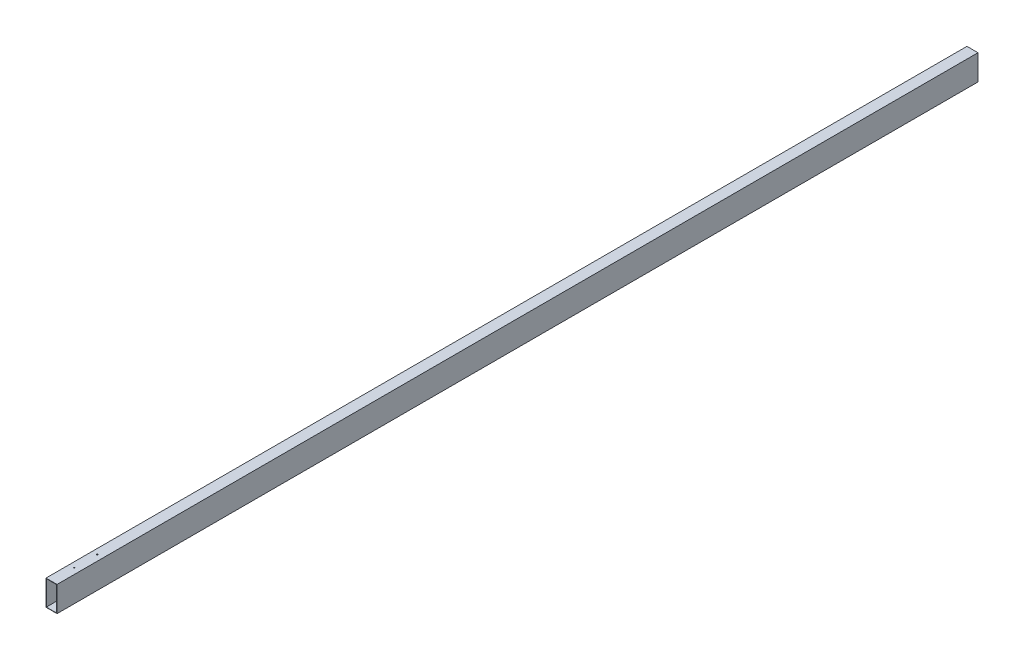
ISO-10303-21;
HEADER;
FILE_DESCRIPTION(('STEP AP214'),'2;1');
FILE_NAME('part.step','',(''),(''),'','','');
FILE_SCHEMA(('AUTOMOTIVE_DESIGN { 1 0 10303 214 1 1 1 1 }'));
ENDSEC;
DATA;
#1=APPLICATION_CONTEXT('core data for automotive mechanical design processes');
#2=APPLICATION_PROTOCOL_DEFINITION('international standard','automotive_design',2000,#1);
#3=PRODUCT_CONTEXT('',#1,'mechanical');
#4=PRODUCT('Part','Part','',(#3));
#5=PRODUCT_RELATED_PRODUCT_CATEGORY('part','',(#4));
#6=PRODUCT_DEFINITION_FORMATION('','',#4);
#7=PRODUCT_DEFINITION_CONTEXT('part definition',#1,'design');
#8=PRODUCT_DEFINITION('design','',#6,#7);
#9=PRODUCT_DEFINITION_SHAPE('','',#8);
#10=(LENGTH_UNIT() NAMED_UNIT(*) SI_UNIT(.MILLI.,.METRE.));
#11=(NAMED_UNIT(*) PLANE_ANGLE_UNIT() SI_UNIT($,.RADIAN.));
#12=(NAMED_UNIT(*) SI_UNIT($,.STERADIAN.) SOLID_ANGLE_UNIT());
#13=UNCERTAINTY_MEASURE_WITH_UNIT(LENGTH_MEASURE(1.E-05),#10,'distance_accuracy_value','');
#14=(GEOMETRIC_REPRESENTATION_CONTEXT(3) GLOBAL_UNCERTAINTY_ASSIGNED_CONTEXT((#13)) GLOBAL_UNIT_ASSIGNED_CONTEXT((#10,
#11,#12)) REPRESENTATION_CONTEXT('',''));
#15=CARTESIAN_POINT('',(0.,0.,0.));
#16=DIRECTION('',(0.,0.,1.));
#17=DIRECTION('',(1.,0.,0.));
#18=AXIS2_PLACEMENT_3D('',#15,#16,#17);
#19=CARTESIAN_POINT('',(0.,0.,4000.));
#20=DIRECTION('',(0.,0.,-1.));
#21=DIRECTION('',(-1.,0.,0.));
#22=AXIS2_PLACEMENT_3D('',#19,#20,#21);
#23=PLANE('',#22);
#24=DIRECTION('',(0.,-1.,0.));
#25=VECTOR('',#24,1.);
#26=CARTESIAN_POINT('',(-24.,-55.,4000.));
#27=LINE('',#26,#25);
#28=CARTESIAN_POINT('',(-24.,55.,4000.));
#29=VERTEX_POINT('',#28);
#30=CARTESIAN_POINT('',(-24.,-55.,4000.));
#31=VERTEX_POINT('',#30);
#32=EDGE_CURVE('E140',#29,#31,#27,.T.);
#33=ORIENTED_EDGE('',*,*,#32,.T.);
#34=DIRECTION('',(1.,0.,0.));
#35=VECTOR('',#34,1.);
#36=CARTESIAN_POINT('',(-24.,-55.,4000.));
#37=LINE('',#36,#35);
#38=CARTESIAN_POINT('',(24.,-55.,4000.));
#39=VERTEX_POINT('',#38);
#40=EDGE_CURVE('E143',#31,#39,#37,.T.);
#41=ORIENTED_EDGE('',*,*,#40,.T.);
#42=DIRECTION('',(0.,1.,0.));
#43=VECTOR('',#42,1.);
#44=CARTESIAN_POINT('',(24.,-55.,4000.));
#45=LINE('',#44,#43);
#46=CARTESIAN_POINT('',(24.,55.,4000.));
#47=VERTEX_POINT('',#46);
#48=EDGE_CURVE('E146',#39,#47,#45,.T.);
#49=ORIENTED_EDGE('',*,*,#48,.T.);
#50=DIRECTION('',(-1.,0.,0.));
#51=VECTOR('',#50,1.);
#52=CARTESIAN_POINT('',(-24.,55.,4000.));
#53=LINE('',#52,#51);
#54=EDGE_CURVE('E148',#47,#29,#53,.T.);
#55=ORIENTED_EDGE('',*,*,#54,.T.);
#56=EDGE_LOOP('',(#33,#41,#49,#55));
#57=FACE_BOUND('',#56,.T.);
#58=DIRECTION('',(0.,1.,0.));
#59=VECTOR('',#58,1.);
#60=CARTESIAN_POINT('',(22.5,-53.5,4000.));
#61=LINE('',#60,#59);
#62=CARTESIAN_POINT('',(22.5,-53.5,4000.));
#63=VERTEX_POINT('',#62);
#64=CARTESIAN_POINT('',(22.5,53.5,4000.));
#65=VERTEX_POINT('',#64);
#66=EDGE_CURVE('E102',#63,#65,#61,.T.);
#67=ORIENTED_EDGE('',*,*,#66,.F.);
#68=DIRECTION('',(1.,0.,0.));
#69=VECTOR('',#68,1.);
#70=CARTESIAN_POINT('',(-22.5,-53.5,4000.));
#71=LINE('',#70,#69);
#72=CARTESIAN_POINT('',(-22.5,-53.5,4000.));
#73=VERTEX_POINT('',#72);
#74=EDGE_CURVE('E124',#73,#63,#71,.T.);
#75=ORIENTED_EDGE('',*,*,#74,.F.);
#76=DIRECTION('',(0.,-1.,0.));
#77=VECTOR('',#76,1.);
#78=CARTESIAN_POINT('',(-22.5,-53.5,4000.));
#79=LINE('',#78,#77);
#80=CARTESIAN_POINT('',(-22.5,53.5,4000.));
#81=VERTEX_POINT('',#80);
#82=EDGE_CURVE('E122',#81,#73,#79,.T.);
#83=ORIENTED_EDGE('',*,*,#82,.F.);
#84=DIRECTION('',(-1.,0.,0.));
#85=VECTOR('',#84,1.);
#86=CARTESIAN_POINT('',(-22.5,53.5,4000.));
#87=LINE('',#86,#85);
#88=EDGE_CURVE('E110',#65,#81,#87,.T.);
#89=ORIENTED_EDGE('',*,*,#88,.F.);
#90=EDGE_LOOP('',(#67,#75,#83,#89));
#91=FACE_BOUND('',#90,.T.);
#92=ADVANCED_FACE('F36',(#57,#91),#23,.F.);
#93=CARTESIAN_POINT('',(0.,0.,0.));
#94=DIRECTION('',(0.,0.,-1.));
#95=DIRECTION('',(-1.,0.,0.));
#96=AXIS2_PLACEMENT_3D('',#93,#94,#95);
#97=PLANE('',#96);
#98=DIRECTION('',(0.,-1.,0.));
#99=VECTOR('',#98,1.);
#100=CARTESIAN_POINT('',(-24.,-55.,0.));
#101=LINE('',#100,#99);
#102=CARTESIAN_POINT('',(-24.,55.,0.));
#103=VERTEX_POINT('',#102);
#104=CARTESIAN_POINT('',(-24.,-55.,0.));
#105=VERTEX_POINT('',#104);
#106=EDGE_CURVE('E118',#103,#105,#101,.T.);
#107=ORIENTED_EDGE('',*,*,#106,.F.);
#108=DIRECTION('',(-1.,0.,0.));
#109=VECTOR('',#108,1.);
#110=CARTESIAN_POINT('',(-24.,55.,0.));
#111=LINE('',#110,#109);
#112=CARTESIAN_POINT('',(24.,55.,0.));
#113=VERTEX_POINT('',#112);
#114=EDGE_CURVE('E144',#113,#103,#111,.T.);
#115=ORIENTED_EDGE('',*,*,#114,.F.);
#116=DIRECTION('',(0.,1.,0.));
#117=VECTOR('',#116,1.);
#118=CARTESIAN_POINT('',(24.,-55.,0.));
#119=LINE('',#118,#117);
#120=CARTESIAN_POINT('',(24.,-55.,0.));
#121=VERTEX_POINT('',#120);
#122=EDGE_CURVE('E155',#121,#113,#119,.T.);
#123=ORIENTED_EDGE('',*,*,#122,.F.);
#124=DIRECTION('',(1.,0.,0.));
#125=VECTOR('',#124,1.);
#126=CARTESIAN_POINT('',(-24.,-55.,0.));
#127=LINE('',#126,#125);
#128=EDGE_CURVE('E153',#105,#121,#127,.T.);
#129=ORIENTED_EDGE('',*,*,#128,.F.);
#130=EDGE_LOOP('',(#107,#115,#123,#129));
#131=FACE_BOUND('',#130,.T.);
#132=DIRECTION('',(1.,0.,0.));
#133=VECTOR('',#132,1.);
#134=CARTESIAN_POINT('',(-22.5,-53.5,0.));
#135=LINE('',#134,#133);
#136=CARTESIAN_POINT('',(-22.5,-53.5,0.));
#137=VERTEX_POINT('',#136);
#138=CARTESIAN_POINT('',(22.5,-53.5,0.));
#139=VERTEX_POINT('',#138);
#140=EDGE_CURVE('E111',#137,#139,#135,.T.);
#141=ORIENTED_EDGE('',*,*,#140,.T.);
#142=DIRECTION('',(0.,1.,0.));
#143=VECTOR('',#142,1.);
#144=CARTESIAN_POINT('',(22.5,-53.5,0.));
#145=LINE('',#144,#143);
#146=CARTESIAN_POINT('',(22.5,53.5,0.));
#147=VERTEX_POINT('',#146);
#148=EDGE_CURVE('E60',#139,#147,#145,.T.);
#149=ORIENTED_EDGE('',*,*,#148,.T.);
#150=DIRECTION('',(-1.,0.,0.));
#151=VECTOR('',#150,1.);
#152=CARTESIAN_POINT('',(-22.5,53.5,0.));
#153=LINE('',#152,#151);
#154=CARTESIAN_POINT('',(-22.5,53.5,0.));
#155=VERTEX_POINT('',#154);
#156=EDGE_CURVE('E117',#147,#155,#153,.T.);
#157=ORIENTED_EDGE('',*,*,#156,.T.);
#158=DIRECTION('',(0.,-1.,0.));
#159=VECTOR('',#158,1.);
#160=CARTESIAN_POINT('',(-22.5,-53.5,0.));
#161=LINE('',#160,#159);
#162=EDGE_CURVE('E132',#155,#137,#161,.T.);
#163=ORIENTED_EDGE('',*,*,#162,.T.);
#164=EDGE_LOOP('',(#141,#149,#157,#163));
#165=FACE_BOUND('',#164,.T.);
#166=ADVANCED_FACE('F174',(#131,#165),#97,.T.);
#167=CARTESIAN_POINT('',(-24.,-55.,4000.));
#168=DIRECTION('',(1.,0.,0.));
#169=DIRECTION('',(0.,0.,-1.));
#170=AXIS2_PLACEMENT_3D('',#167,#168,#169);
#171=PLANE('',#170);
#172=CARTESIAN_POINT('',(-24.,4.99999999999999,3850.));
#173=DIRECTION('',(-1.,0.,0.));
#174=DIRECTION('',(0.,0.,1.));
#175=AXIS2_PLACEMENT_3D('',#172,#173,#174);
#176=CIRCLE('',#175,14.9999999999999);
#177=CARTESIAN_POINT('',(-24.,4.99999999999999,3865.));
#178=VERTEX_POINT('',#177);
#179=EDGE_CURVE('E236',#178,#178,#176,.T.);
#180=ORIENTED_EDGE('',*,*,#179,.F.);
#181=EDGE_LOOP('',(#180));
#182=FACE_BOUND('',#181,.T.);
#183=ORIENTED_EDGE('',*,*,#106,.T.);
#184=DIRECTION('',(0.,0.,-1.));
#185=VECTOR('',#184,1.);
#186=CARTESIAN_POINT('',(-24.,-55.,4000.));
#187=LINE('',#186,#185);
#188=EDGE_CURVE('E11',#31,#105,#187,.T.);
#189=ORIENTED_EDGE('',*,*,#188,.F.);
#190=ORIENTED_EDGE('',*,*,#32,.F.);
#191=DIRECTION('',(0.,0.,-1.));
#192=VECTOR('',#191,1.);
#193=CARTESIAN_POINT('',(-24.,55.,4000.));
#194=LINE('',#193,#192);
#195=EDGE_CURVE('E150',#29,#103,#194,.T.);
#196=ORIENTED_EDGE('',*,*,#195,.T.);
#197=EDGE_LOOP('',(#183,#189,#190,#196));
#198=FACE_BOUND('',#197,.T.);
#199=ADVANCED_FACE('F38',(#182,#198),#171,.F.);
#200=CARTESIAN_POINT('',(-24.,-55.,4000.));
#201=DIRECTION('',(0.,1.,0.));
#202=DIRECTION('',(0.,0.,1.));
#203=AXIS2_PLACEMENT_3D('',#200,#201,#202);
#204=PLANE('',#203);
#205=CARTESIAN_POINT('',(-1.5,-55.,3800.));
#206=DIRECTION('',(0.,-1.,0.));
#207=DIRECTION('',(0.,0.,-1.));
#208=AXIS2_PLACEMENT_3D('',#205,#206,#207);
#209=CIRCLE('',#208,2.49999999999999);
#210=CARTESIAN_POINT('',(-1.5,-55.,3797.5));
#211=VERTEX_POINT('',#210);
#212=EDGE_CURVE('E230',#211,#211,#209,.T.);
#213=ORIENTED_EDGE('',*,*,#212,.F.);
#214=EDGE_LOOP('',(#213));
#215=FACE_BOUND('',#214,.T.);
#216=CARTESIAN_POINT('',(-1.5,-55.,3900.));
#217=DIRECTION('',(0.,-1.,0.));
#218=DIRECTION('',(0.,0.,-1.));
#219=AXIS2_PLACEMENT_3D('',#216,#217,#218);
#220=CIRCLE('',#219,2.49999999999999);
#221=CARTESIAN_POINT('',(-1.5,-55.,3897.5));
#222=VERTEX_POINT('',#221);
#223=EDGE_CURVE('E227',#222,#222,#220,.T.);
#224=ORIENTED_EDGE('',*,*,#223,.F.);
#225=EDGE_LOOP('',(#224));
#226=FACE_BOUND('',#225,.T.);
#227=ORIENTED_EDGE('',*,*,#128,.T.);
#228=DIRECTION('',(0.,0.,-1.));
#229=VECTOR('',#228,1.);
#230=CARTESIAN_POINT('',(24.,-55.,4000.));
#231=LINE('',#230,#229);
#232=EDGE_CURVE('E45',#39,#121,#231,.T.);
#233=ORIENTED_EDGE('',*,*,#232,.F.);
#234=ORIENTED_EDGE('',*,*,#40,.F.);
#235=ORIENTED_EDGE('',*,*,#188,.T.);
#236=EDGE_LOOP('',(#227,#233,#234,#235));
#237=FACE_BOUND('',#236,.T.);
#238=ADVANCED_FACE('F184',(#215,#226,#237),#204,.F.);
#239=CARTESIAN_POINT('',(24.,-55.,4000.));
#240=DIRECTION('',(-1.,0.,0.));
#241=DIRECTION('',(0.,0.,1.));
#242=AXIS2_PLACEMENT_3D('',#239,#240,#241);
#243=PLANE('',#242);
#244=ORIENTED_EDGE('',*,*,#122,.T.);
#245=DIRECTION('',(0.,0.,-1.));
#246=VECTOR('',#245,1.);
#247=CARTESIAN_POINT('',(24.,55.,4000.));
#248=LINE('',#247,#246);
#249=EDGE_CURVE('E160',#47,#113,#248,.T.);
#250=ORIENTED_EDGE('',*,*,#249,.F.);
#251=ORIENTED_EDGE('',*,*,#48,.F.);
#252=ORIENTED_EDGE('',*,*,#232,.T.);
#253=EDGE_LOOP('',(#244,#250,#251,#252));
#254=FACE_BOUND('',#253,.T.);
#255=ADVANCED_FACE('F168',(#254),#243,.F.);
#256=CARTESIAN_POINT('',(-24.,55.,4000.));
#257=DIRECTION('',(0.,-1.,0.));
#258=DIRECTION('',(0.,0.,-1.));
#259=AXIS2_PLACEMENT_3D('',#256,#257,#258);
#260=PLANE('',#259);
#261=CARTESIAN_POINT('',(-1.5,55.,3800.));
#262=DIRECTION('',(0.,1.,0.));
#263=DIRECTION('',(0.,0.,1.));
#264=AXIS2_PLACEMENT_3D('',#261,#262,#263);
#265=CIRCLE('',#264,2.49999999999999);
#266=CARTESIAN_POINT('',(-1.5,55.,3802.5));
#267=VERTEX_POINT('',#266);
#268=EDGE_CURVE('E212',#267,#267,#265,.T.);
#269=ORIENTED_EDGE('',*,*,#268,.F.);
#270=EDGE_LOOP('',(#269));
#271=FACE_BOUND('',#270,.T.);
#272=CARTESIAN_POINT('',(-1.5,55.,3900.));
#273=DIRECTION('',(0.,1.,0.));
#274=DIRECTION('',(0.,0.,1.));
#275=AXIS2_PLACEMENT_3D('',#272,#273,#274);
#276=CIRCLE('',#275,2.49999999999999);
#277=CARTESIAN_POINT('',(-1.5,55.,3902.5));
#278=VERTEX_POINT('',#277);
#279=EDGE_CURVE('E215',#278,#278,#276,.T.);
#280=ORIENTED_EDGE('',*,*,#279,.F.);
#281=EDGE_LOOP('',(#280));
#282=FACE_BOUND('',#281,.T.);
#283=ORIENTED_EDGE('',*,*,#114,.T.);
#284=ORIENTED_EDGE('',*,*,#195,.F.);
#285=ORIENTED_EDGE('',*,*,#54,.F.);
#286=ORIENTED_EDGE('',*,*,#249,.T.);
#287=EDGE_LOOP('',(#283,#284,#285,#286));
#288=FACE_BOUND('',#287,.T.);
#289=ADVANCED_FACE('F178',(#271,#282,#288),#260,.F.);
#290=CARTESIAN_POINT('',(22.5,-53.5,4000.));
#291=DIRECTION('',(-1.,0.,0.));
#292=DIRECTION('',(0.,0.,1.));
#293=AXIS2_PLACEMENT_3D('',#290,#291,#292);
#294=PLANE('',#293);
#295=ORIENTED_EDGE('',*,*,#148,.F.);
#296=DIRECTION('',(0.,0.,-1.));
#297=VECTOR('',#296,1.);
#298=CARTESIAN_POINT('',(22.5,-53.5,4000.));
#299=LINE('',#298,#297);
#300=EDGE_CURVE('E106',#63,#139,#299,.T.);
#301=ORIENTED_EDGE('',*,*,#300,.F.);
#302=ORIENTED_EDGE('',*,*,#66,.T.);
#303=DIRECTION('',(0.,0.,-1.));
#304=VECTOR('',#303,1.);
#305=CARTESIAN_POINT('',(22.5,53.5,4000.));
#306=LINE('',#305,#304);
#307=EDGE_CURVE('E105',#65,#147,#306,.T.);
#308=ORIENTED_EDGE('',*,*,#307,.T.);
#309=EDGE_LOOP('',(#295,#301,#302,#308));
#310=FACE_BOUND('',#309,.T.);
#311=ADVANCED_FACE('F104',(#310),#294,.T.);
#312=CARTESIAN_POINT('',(-22.5,53.5,4000.));
#313=DIRECTION('',(0.,-1.,0.));
#314=DIRECTION('',(0.,0.,-1.));
#315=AXIS2_PLACEMENT_3D('',#312,#313,#314);
#316=PLANE('',#315);
#317=CARTESIAN_POINT('',(-1.5,53.5,3800.));
#318=DIRECTION('',(0.,-1.,0.));
#319=DIRECTION('',(0.,0.,-1.));
#320=AXIS2_PLACEMENT_3D('',#317,#318,#319);
#321=CIRCLE('',#320,2.49999999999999);
#322=CARTESIAN_POINT('',(-1.5,53.5,3797.5));
#323=VERTEX_POINT('',#322);
#324=EDGE_CURVE('E219',#323,#323,#321,.T.);
#325=ORIENTED_EDGE('',*,*,#324,.F.);
#326=EDGE_LOOP('',(#325));
#327=FACE_BOUND('',#326,.T.);
#328=CARTESIAN_POINT('',(-1.5,53.5,3900.));
#329=DIRECTION('',(0.,-1.,0.));
#330=DIRECTION('',(0.,0.,-1.));
#331=AXIS2_PLACEMENT_3D('',#328,#329,#330);
#332=CIRCLE('',#331,2.49999999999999);
#333=CARTESIAN_POINT('',(-1.5,53.5,3897.5));
#334=VERTEX_POINT('',#333);
#335=EDGE_CURVE('E130',#334,#334,#332,.T.);
#336=ORIENTED_EDGE('',*,*,#335,.F.);
#337=EDGE_LOOP('',(#336));
#338=FACE_BOUND('',#337,.T.);
#339=ORIENTED_EDGE('',*,*,#156,.F.);
#340=ORIENTED_EDGE('',*,*,#307,.F.);
#341=ORIENTED_EDGE('',*,*,#88,.T.);
#342=DIRECTION('',(0.,0.,-1.));
#343=VECTOR('',#342,1.);
#344=CARTESIAN_POINT('',(-22.5,53.5,4000.));
#345=LINE('',#344,#343);
#346=EDGE_CURVE('E119',#81,#155,#345,.T.);
#347=ORIENTED_EDGE('',*,*,#346,.T.);
#348=EDGE_LOOP('',(#339,#340,#341,#347));
#349=FACE_BOUND('',#348,.T.);
#350=ADVANCED_FACE('F114',(#327,#338,#349),#316,.T.);
#351=CARTESIAN_POINT('',(-22.5,-53.5,4000.));
#352=DIRECTION('',(1.,0.,0.));
#353=DIRECTION('',(0.,0.,-1.));
#354=AXIS2_PLACEMENT_3D('',#351,#352,#353);
#355=PLANE('',#354);
#356=CARTESIAN_POINT('',(-22.5,4.99999999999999,3850.));
#357=DIRECTION('',(1.,0.,0.));
#358=DIRECTION('',(0.,0.,-1.));
#359=AXIS2_PLACEMENT_3D('',#356,#357,#358);
#360=CIRCLE('',#359,14.9999999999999);
#361=CARTESIAN_POINT('',(-22.5,4.99999999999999,3835.));
#362=VERTEX_POINT('',#361);
#363=EDGE_CURVE('E40',#362,#362,#360,.T.);
#364=ORIENTED_EDGE('',*,*,#363,.F.);
#365=EDGE_LOOP('',(#364));
#366=FACE_BOUND('',#365,.T.);
#367=ORIENTED_EDGE('',*,*,#162,.F.);
#368=ORIENTED_EDGE('',*,*,#346,.F.);
#369=ORIENTED_EDGE('',*,*,#82,.T.);
#370=DIRECTION('',(0.,0.,-1.));
#371=VECTOR('',#370,1.);
#372=CARTESIAN_POINT('',(-22.5,-53.5,4000.));
#373=LINE('',#372,#371);
#374=EDGE_CURVE('E52',#73,#137,#373,.T.);
#375=ORIENTED_EDGE('',*,*,#374,.T.);
#376=EDGE_LOOP('',(#367,#368,#369,#375));
#377=FACE_BOUND('',#376,.T.);
#378=ADVANCED_FACE('F245',(#366,#377),#355,.T.);
#379=CARTESIAN_POINT('',(-22.5,-53.5,4000.));
#380=DIRECTION('',(0.,1.,0.));
#381=DIRECTION('',(0.,0.,1.));
#382=AXIS2_PLACEMENT_3D('',#379,#380,#381);
#383=PLANE('',#382);
#384=CARTESIAN_POINT('',(-1.5,-53.5,3800.));
#385=DIRECTION('',(0.,1.,0.));
#386=DIRECTION('',(0.,0.,1.));
#387=AXIS2_PLACEMENT_3D('',#384,#385,#386);
#388=CIRCLE('',#387,2.49999999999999);
#389=CARTESIAN_POINT('',(-1.5,-53.5,3802.5));
#390=VERTEX_POINT('',#389);
#391=EDGE_CURVE('E233',#390,#390,#388,.T.);
#392=ORIENTED_EDGE('',*,*,#391,.F.);
#393=EDGE_LOOP('',(#392));
#394=FACE_BOUND('',#393,.T.);
#395=CARTESIAN_POINT('',(-1.5,-53.5,3900.));
#396=DIRECTION('',(0.,1.,0.));
#397=DIRECTION('',(0.,0.,1.));
#398=AXIS2_PLACEMENT_3D('',#395,#396,#397);
#399=CIRCLE('',#398,2.49999999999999);
#400=CARTESIAN_POINT('',(-1.5,-53.5,3902.5));
#401=VERTEX_POINT('',#400);
#402=EDGE_CURVE('E224',#401,#401,#399,.T.);
#403=ORIENTED_EDGE('',*,*,#402,.F.);
#404=EDGE_LOOP('',(#403));
#405=FACE_BOUND('',#404,.T.);
#406=ORIENTED_EDGE('',*,*,#140,.F.);
#407=ORIENTED_EDGE('',*,*,#374,.F.);
#408=ORIENTED_EDGE('',*,*,#74,.T.);
#409=ORIENTED_EDGE('',*,*,#300,.T.);
#410=EDGE_LOOP('',(#406,#407,#408,#409));
#411=FACE_BOUND('',#410,.T.);
#412=ADVANCED_FACE('F248',(#394,#405,#411),#383,.T.);
#413=CARTESIAN_POINT('',(-1.5,55.,3900.));
#414=DIRECTION('',(0.,1.,0.));
#415=DIRECTION('',(0.,0.,1.));
#416=AXIS2_PLACEMENT_3D('',#413,#414,#415);
#417=CYLINDRICAL_SURFACE('',#416,2.49999999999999);
#418=ORIENTED_EDGE('',*,*,#335,.T.);
#419=EDGE_LOOP('',(#418));
#420=FACE_BOUND('',#419,.T.);
#421=ORIENTED_EDGE('',*,*,#279,.T.);
#422=EDGE_LOOP('',(#421));
#423=FACE_BOUND('',#422,.T.);
#424=ADVANCED_FACE('F252',(#420,#423),#417,.F.);
#425=CARTESIAN_POINT('',(-1.5,55.,3800.));
#426=DIRECTION('',(0.,1.,0.));
#427=DIRECTION('',(0.,0.,1.));
#428=AXIS2_PLACEMENT_3D('',#425,#426,#427);
#429=CYLINDRICAL_SURFACE('',#428,2.49999999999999);
#430=ORIENTED_EDGE('',*,*,#324,.T.);
#431=EDGE_LOOP('',(#430));
#432=FACE_BOUND('',#431,.T.);
#433=ORIENTED_EDGE('',*,*,#268,.T.);
#434=EDGE_LOOP('',(#433));
#435=FACE_BOUND('',#434,.T.);
#436=ADVANCED_FACE('F258',(#432,#435),#429,.F.);
#437=CARTESIAN_POINT('',(-1.5,-55.,3900.));
#438=DIRECTION('',(0.,-1.,0.));
#439=DIRECTION('',(0.,0.,-1.));
#440=AXIS2_PLACEMENT_3D('',#437,#438,#439);
#441=CYLINDRICAL_SURFACE('',#440,2.49999999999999);
#442=ORIENTED_EDGE('',*,*,#402,.T.);
#443=EDGE_LOOP('',(#442));
#444=FACE_BOUND('',#443,.T.);
#445=ORIENTED_EDGE('',*,*,#223,.T.);
#446=EDGE_LOOP('',(#445));
#447=FACE_BOUND('',#446,.T.);
#448=ADVANCED_FACE('F274',(#444,#447),#441,.F.);
#449=CARTESIAN_POINT('',(-1.5,-55.,3800.));
#450=DIRECTION('',(0.,-1.,0.));
#451=DIRECTION('',(0.,0.,-1.));
#452=AXIS2_PLACEMENT_3D('',#449,#450,#451);
#453=CYLINDRICAL_SURFACE('',#452,2.49999999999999);
#454=ORIENTED_EDGE('',*,*,#391,.T.);
#455=EDGE_LOOP('',(#454));
#456=FACE_BOUND('',#455,.T.);
#457=ORIENTED_EDGE('',*,*,#212,.T.);
#458=EDGE_LOOP('',(#457));
#459=FACE_BOUND('',#458,.T.);
#460=ADVANCED_FACE('F278',(#456,#459),#453,.F.);
#461=CARTESIAN_POINT('',(-14.,4.99999999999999,3850.));
#462=DIRECTION('',(-1.,0.,0.));
#463=DIRECTION('',(0.,0.,1.));
#464=AXIS2_PLACEMENT_3D('',#461,#462,#463);
#465=CYLINDRICAL_SURFACE('',#464,14.9999999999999);
#466=ORIENTED_EDGE('',*,*,#363,.T.);
#467=EDGE_LOOP('',(#466));
#468=FACE_BOUND('',#467,.T.);
#469=ORIENTED_EDGE('',*,*,#179,.T.);
#470=EDGE_LOOP('',(#469));
#471=FACE_BOUND('',#470,.T.);
#472=ADVANCED_FACE('F243',(#468,#471),#465,.F.);
#473=CLOSED_SHELL('',(#92,#166,#199,#238,#255,#289,#311,#350,#378,#412,#424,#436,#448,#460,#472));
#474=MANIFOLD_SOLID_BREP('B2',#473);
#475=ADVANCED_BREP_SHAPE_REPRESENTATION('',(#18,#474),#14);
#476=SHAPE_DEFINITION_REPRESENTATION(#9,#475);
ENDSEC;
END-ISO-10303-21;
